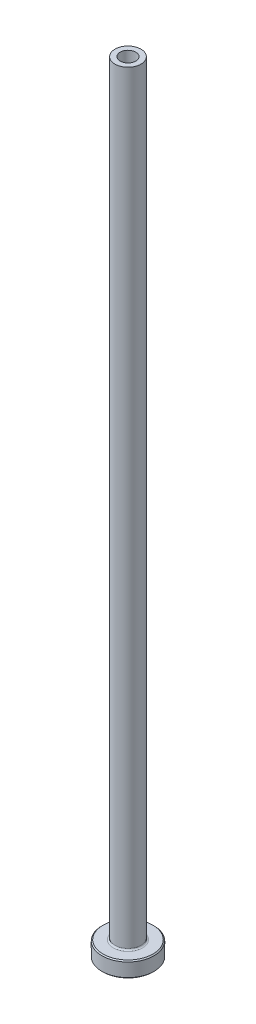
ISO-10303-21;
HEADER;
FILE_DESCRIPTION(('STEP AP214'),'2;1');
FILE_NAME('part.step','',(''),(''),'','','');
FILE_SCHEMA(('AUTOMOTIVE_DESIGN { 1 0 10303 214 1 1 1 1 }'));
ENDSEC;
DATA;
#1=APPLICATION_CONTEXT('core data for automotive mechanical design processes');
#2=APPLICATION_PROTOCOL_DEFINITION('international standard','automotive_design',2000,#1);
#3=PRODUCT_CONTEXT('',#1,'mechanical');
#4=PRODUCT('Part','Part','',(#3));
#5=PRODUCT_RELATED_PRODUCT_CATEGORY('part','',(#4));
#6=PRODUCT_DEFINITION_FORMATION('','',#4);
#7=PRODUCT_DEFINITION_CONTEXT('part definition',#1,'design');
#8=PRODUCT_DEFINITION('design','',#6,#7);
#9=PRODUCT_DEFINITION_SHAPE('','',#8);
#10=(LENGTH_UNIT() NAMED_UNIT(*) SI_UNIT(.MILLI.,.METRE.));
#11=(NAMED_UNIT(*) PLANE_ANGLE_UNIT() SI_UNIT($,.RADIAN.));
#12=(NAMED_UNIT(*) SI_UNIT($,.STERADIAN.) SOLID_ANGLE_UNIT());
#13=UNCERTAINTY_MEASURE_WITH_UNIT(LENGTH_MEASURE(1.E-05),#10,'distance_accuracy_value','');
#14=(GEOMETRIC_REPRESENTATION_CONTEXT(3) GLOBAL_UNCERTAINTY_ASSIGNED_CONTEXT((#13)) GLOBAL_UNIT_ASSIGNED_CONTEXT((#10,
#11,#12)) REPRESENTATION_CONTEXT('',''));
#15=CARTESIAN_POINT('',(0.,0.,0.));
#16=DIRECTION('',(0.,0.,1.));
#17=DIRECTION('',(1.,0.,0.));
#18=AXIS2_PLACEMENT_3D('',#15,#16,#17);
#19=CARTESIAN_POINT('',(0.,92.1876809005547,0.));
#20=DIRECTION('',(0.,1.,0.));
#21=DIRECTION('',(0.,0.,1.));
#22=AXIS2_PLACEMENT_3D('',#19,#20,#21);
#23=CYLINDRICAL_SURFACE('',#22,1.5);
#24=CARTESIAN_POINT('',(0.,150.,0.));
#25=DIRECTION('',(0.,1.,0.));
#26=DIRECTION('',(0.,0.,1.));
#27=AXIS2_PLACEMENT_3D('',#24,#25,#26);
#28=CIRCLE('',#27,1.5);
#29=CARTESIAN_POINT('',(0.,150.,1.5));
#30=VERTEX_POINT('',#29);
#31=EDGE_CURVE('E62',#30,#30,#28,.T.);
#32=ORIENTED_EDGE('',*,*,#31,.T.);
#33=EDGE_LOOP('',(#32));
#34=FACE_BOUND('',#33,.T.);
#35=CARTESIAN_POINT('',(0.,105.,0.));
#36=DIRECTION('',(0.,1.,0.));
#37=DIRECTION('',(0.,0.,1.));
#38=AXIS2_PLACEMENT_3D('',#35,#36,#37);
#39=CIRCLE('',#38,1.5);
#40=CARTESIAN_POINT('',(0.,105.,1.5));
#41=VERTEX_POINT('',#40);
#42=EDGE_CURVE('E71',#41,#41,#39,.T.);
#43=ORIENTED_EDGE('',*,*,#42,.F.);
#44=EDGE_LOOP('',(#43));
#45=FACE_BOUND('',#44,.T.);
#46=ADVANCED_FACE('F30',(#34,#45),#23,.F.);
#47=CARTESIAN_POINT('',(-1.5,150.,0.));
#48=DIRECTION('',(0.,1.,0.));
#49=DIRECTION('',(0.,0.,1.));
#50=AXIS2_PLACEMENT_3D('',#47,#48,#49);
#51=PLANE('',#50);
#52=CARTESIAN_POINT('',(0.,150.,0.));
#53=DIRECTION('',(0.,1.,0.));
#54=DIRECTION('',(0.,0.,1.));
#55=AXIS2_PLACEMENT_3D('',#52,#53,#54);
#56=CIRCLE('',#55,2.50000000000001);
#57=CARTESIAN_POINT('',(0.,150.,2.50000000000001));
#58=VERTEX_POINT('',#57);
#59=EDGE_CURVE('E65',#58,#58,#56,.T.);
#60=ORIENTED_EDGE('',*,*,#59,.T.);
#61=EDGE_LOOP('',(#60));
#62=FACE_BOUND('',#61,.T.);
#63=ORIENTED_EDGE('',*,*,#31,.F.);
#64=EDGE_LOOP('',(#63));
#65=FACE_BOUND('',#64,.T.);
#66=ADVANCED_FACE('F79',(#62,#65),#51,.T.);
#67=CARTESIAN_POINT('',(0.,92.1876809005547,0.));
#68=DIRECTION('',(0.,1.,0.));
#69=DIRECTION('',(0.,0.,1.));
#70=AXIS2_PLACEMENT_3D('',#67,#68,#69);
#71=CYLINDRICAL_SURFACE('',#70,2.5);
#72=CARTESIAN_POINT('',(0.,3.3,0.));
#73=DIRECTION('',(0.,1.,0.));
#74=DIRECTION('',(0.,0.,1.));
#75=AXIS2_PLACEMENT_3D('',#72,#73,#74);
#76=CIRCLE('',#75,2.5);
#77=CARTESIAN_POINT('',(0.,3.3,2.5));
#78=VERTEX_POINT('',#77);
#79=EDGE_CURVE('E59',#78,#78,#76,.T.);
#80=ORIENTED_EDGE('',*,*,#79,.T.);
#81=EDGE_LOOP('',(#80));
#82=FACE_BOUND('',#81,.T.);
#83=ORIENTED_EDGE('',*,*,#59,.F.);
#84=EDGE_LOOP('',(#83));
#85=FACE_BOUND('',#84,.T.);
#86=ADVANCED_FACE('F85',(#82,#85),#71,.T.);
#87=CARTESIAN_POINT('',(-2.49999999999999,3.,0.));
#88=DIRECTION('',(0.,1.,0.));
#89=DIRECTION('',(0.,0.,1.));
#90=AXIS2_PLACEMENT_3D('',#87,#88,#89);
#91=PLANE('',#90);
#92=CARTESIAN_POINT('',(0.,3.,0.));
#93=DIRECTION('',(0.,1.,0.));
#94=DIRECTION('',(0.,0.,1.));
#95=AXIS2_PLACEMENT_3D('',#92,#93,#94);
#96=CIRCLE('',#95,4.79999999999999);
#97=CARTESIAN_POINT('',(0.,3.,4.79999999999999));
#98=VERTEX_POINT('',#97);
#99=EDGE_CURVE('E53',#98,#98,#96,.T.);
#100=ORIENTED_EDGE('',*,*,#99,.T.);
#101=EDGE_LOOP('',(#100));
#102=FACE_BOUND('',#101,.T.);
#103=CARTESIAN_POINT('',(0.,3.,0.));
#104=DIRECTION('',(0.,1.,0.));
#105=DIRECTION('',(0.,0.,1.));
#106=AXIS2_PLACEMENT_3D('',#103,#104,#105);
#107=CIRCLE('',#106,2.8);
#108=CARTESIAN_POINT('',(0.,3.,2.8));
#109=VERTEX_POINT('',#108);
#110=EDGE_CURVE('E56',#109,#109,#107,.F.);
#111=ORIENTED_EDGE('',*,*,#110,.T.);
#112=EDGE_LOOP('',(#111));
#113=FACE_BOUND('',#112,.T.);
#114=ADVANCED_FACE('F111',(#102,#113),#91,.T.);
#115=CARTESIAN_POINT('',(0.,92.1876809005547,0.));
#116=DIRECTION('',(0.,1.,0.));
#117=DIRECTION('',(0.,0.,1.));
#118=AXIS2_PLACEMENT_3D('',#115,#116,#117);
#119=CYLINDRICAL_SURFACE('',#118,4.99999999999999);
#120=CARTESIAN_POINT('',(0.,2.8,0.));
#121=DIRECTION('',(0.,1.,0.));
#122=DIRECTION('',(0.,0.,1.));
#123=AXIS2_PLACEMENT_3D('',#120,#121,#122);
#124=CIRCLE('',#123,4.99999999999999);
#125=CARTESIAN_POINT('',(0.,2.8,4.99999999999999));
#126=VERTEX_POINT('',#125);
#127=EDGE_CURVE('E45',#126,#126,#124,.F.);
#128=ORIENTED_EDGE('',*,*,#127,.T.);
#129=EDGE_LOOP('',(#128));
#130=FACE_BOUND('',#129,.T.);
#131=CARTESIAN_POINT('',(0.,0.199999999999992,0.));
#132=DIRECTION('',(0.,-1.,0.));
#133=DIRECTION('',(0.,0.,-1.));
#134=AXIS2_PLACEMENT_3D('',#131,#132,#133);
#135=CIRCLE('',#134,4.99999999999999);
#136=CARTESIAN_POINT('',(0.,0.199999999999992,-4.99999999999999));
#137=VERTEX_POINT('',#136);
#138=EDGE_CURVE('E50',#137,#137,#135,.F.);
#139=ORIENTED_EDGE('',*,*,#138,.T.);
#140=EDGE_LOOP('',(#139));
#141=FACE_BOUND('',#140,.T.);
#142=ADVANCED_FACE('F108',(#130,#141),#119,.T.);
#143=CARTESIAN_POINT('',(-4.99999999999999,0.,0.));
#144=DIRECTION('',(0.,-1.,0.));
#145=DIRECTION('',(0.,0.,-1.));
#146=AXIS2_PLACEMENT_3D('',#143,#144,#145);
#147=PLANE('',#146);
#148=CARTESIAN_POINT('',(0.,0.,0.));
#149=DIRECTION('',(0.,-1.,0.));
#150=DIRECTION('',(0.,0.,-1.));
#151=AXIS2_PLACEMENT_3D('',#148,#149,#150);
#152=CIRCLE('',#151,2.24999999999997);
#153=CARTESIAN_POINT('',(0.,0.,-2.24999999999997));
#154=VERTEX_POINT('',#153);
#155=EDGE_CURVE('E37',#154,#154,#152,.F.);
#156=ORIENTED_EDGE('',*,*,#155,.T.);
#157=EDGE_LOOP('',(#156));
#158=FACE_BOUND('',#157,.T.);
#159=CARTESIAN_POINT('',(0.,0.,0.));
#160=DIRECTION('',(0.,-1.,0.));
#161=DIRECTION('',(0.,0.,-1.));
#162=AXIS2_PLACEMENT_3D('',#159,#160,#161);
#163=CIRCLE('',#162,4.8);
#164=CARTESIAN_POINT('',(0.,0.,-4.8));
#165=VERTEX_POINT('',#164);
#166=EDGE_CURVE('E41',#165,#165,#163,.T.);
#167=ORIENTED_EDGE('',*,*,#166,.T.);
#168=EDGE_LOOP('',(#167));
#169=FACE_BOUND('',#168,.T.);
#170=ADVANCED_FACE('F110',(#158,#169),#147,.T.);
#171=CARTESIAN_POINT('',(0.,92.1876809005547,0.));
#172=DIRECTION('',(0.,1.,0.));
#173=DIRECTION('',(0.,0.,1.));
#174=AXIS2_PLACEMENT_3D('',#171,#172,#173);
#175=CYLINDRICAL_SURFACE('',#174,1.75);
#176=CARTESIAN_POINT('',(0.,0.499999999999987,0.));
#177=DIRECTION('',(0.,-1.,0.));
#178=DIRECTION('',(0.,0.,-1.));
#179=AXIS2_PLACEMENT_3D('',#176,#177,#178);
#180=CIRCLE('',#179,1.75);
#181=CARTESIAN_POINT('',(0.,0.499999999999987,-1.75));
#182=VERTEX_POINT('',#181);
#183=EDGE_CURVE('E10',#182,#182,#180,.T.);
#184=ORIENTED_EDGE('',*,*,#183,.T.);
#185=EDGE_LOOP('',(#184));
#186=FACE_BOUND('',#185,.T.);
#187=CARTESIAN_POINT('',(0.,93.,0.));
#188=DIRECTION('',(0.,1.,0.));
#189=DIRECTION('',(0.,0.,1.));
#190=AXIS2_PLACEMENT_3D('',#187,#188,#189);
#191=CIRCLE('',#190,1.75);
#192=CARTESIAN_POINT('',(0.,93.,1.75));
#193=VERTEX_POINT('',#192);
#194=EDGE_CURVE('E68',#193,#193,#191,.T.);
#195=ORIENTED_EDGE('',*,*,#194,.T.);
#196=EDGE_LOOP('',(#195));
#197=FACE_BOUND('',#196,.T.);
#198=ADVANCED_FACE('F118',(#186,#197),#175,.F.);
#199=CARTESIAN_POINT('',(0.,93.,0.));
#200=DIRECTION('',(0.,-1.,0.));
#201=DIRECTION('',(0.,0.,-1.));
#202=AXIS2_PLACEMENT_3D('',#199,#200,#201);
#203=CONICAL_SURFACE('',#202,1.75,0.0208303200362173);
#204=ORIENTED_EDGE('',*,*,#42,.T.);
#205=EDGE_LOOP('',(#204));
#206=FACE_BOUND('',#205,.T.);
#207=ORIENTED_EDGE('',*,*,#194,.F.);
#208=EDGE_LOOP('',(#207));
#209=FACE_BOUND('',#208,.T.);
#210=ADVANCED_FACE('F75',(#206,#209),#203,.F.);
#211=CARTESIAN_POINT('',(0.,3.3,0.));
#212=DIRECTION('',(0.,1.,0.));
#213=DIRECTION('',(0.,0.,1.));
#214=AXIS2_PLACEMENT_3D('',#211,#212,#213);
#215=TOROIDAL_SURFACE('',#214,2.8,0.3);
#216=ORIENTED_EDGE('',*,*,#110,.F.);
#217=EDGE_LOOP('',(#216));
#218=FACE_BOUND('',#217,.T.);
#219=ORIENTED_EDGE('',*,*,#79,.F.);
#220=EDGE_LOOP('',(#219));
#221=FACE_BOUND('',#220,.T.);
#222=ADVANCED_FACE('F90',(#218,#221),#215,.F.);
#223=CARTESIAN_POINT('',(0.,3.,0.));
#224=DIRECTION('',(0.,-1.,0.));
#225=DIRECTION('',(0.,0.,-1.));
#226=AXIS2_PLACEMENT_3D('',#223,#224,#225);
#227=CONICAL_SURFACE('',#226,4.79999999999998,0.785398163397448);
#228=ORIENTED_EDGE('',*,*,#127,.F.);
#229=EDGE_LOOP('',(#228));
#230=FACE_BOUND('',#229,.T.);
#231=ORIENTED_EDGE('',*,*,#99,.F.);
#232=EDGE_LOOP('',(#231));
#233=FACE_BOUND('',#232,.T.);
#234=ADVANCED_FACE('F93',(#230,#233),#227,.T.);
#235=CARTESIAN_POINT('',(0.,0.199999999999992,0.));
#236=DIRECTION('',(0.,1.,0.));
#237=DIRECTION('',(0.,0.,1.));
#238=AXIS2_PLACEMENT_3D('',#235,#236,#237);
#239=CONICAL_SURFACE('',#238,4.99999999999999,0.785398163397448);
#240=ORIENTED_EDGE('',*,*,#166,.F.);
#241=EDGE_LOOP('',(#240));
#242=FACE_BOUND('',#241,.T.);
#243=ORIENTED_EDGE('',*,*,#138,.F.);
#244=EDGE_LOOP('',(#243));
#245=FACE_BOUND('',#244,.T.);
#246=ADVANCED_FACE('F96',(#242,#245),#239,.T.);
#247=CARTESIAN_POINT('',(0.,0.,0.));
#248=DIRECTION('',(0.,-1.,0.));
#249=DIRECTION('',(0.,0.,-1.));
#250=AXIS2_PLACEMENT_3D('',#247,#248,#249);
#251=CONICAL_SURFACE('',#250,2.24999999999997,0.78539816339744);
#252=ORIENTED_EDGE('',*,*,#183,.F.);
#253=EDGE_LOOP('',(#252));
#254=FACE_BOUND('',#253,.T.);
#255=ORIENTED_EDGE('',*,*,#155,.F.);
#256=EDGE_LOOP('',(#255));
#257=FACE_BOUND('',#256,.T.);
#258=ADVANCED_FACE('F32',(#254,#257),#251,.F.);
#259=CLOSED_SHELL('',(#46,#66,#86,#114,#142,#170,#198,#210,#222,#234,#246,#258));
#260=MANIFOLD_SOLID_BREP('B2',#259);
#261=ADVANCED_BREP_SHAPE_REPRESENTATION('',(#18,#260),#14);
#262=SHAPE_DEFINITION_REPRESENTATION(#9,#261);
ENDSEC;
END-ISO-10303-21;
